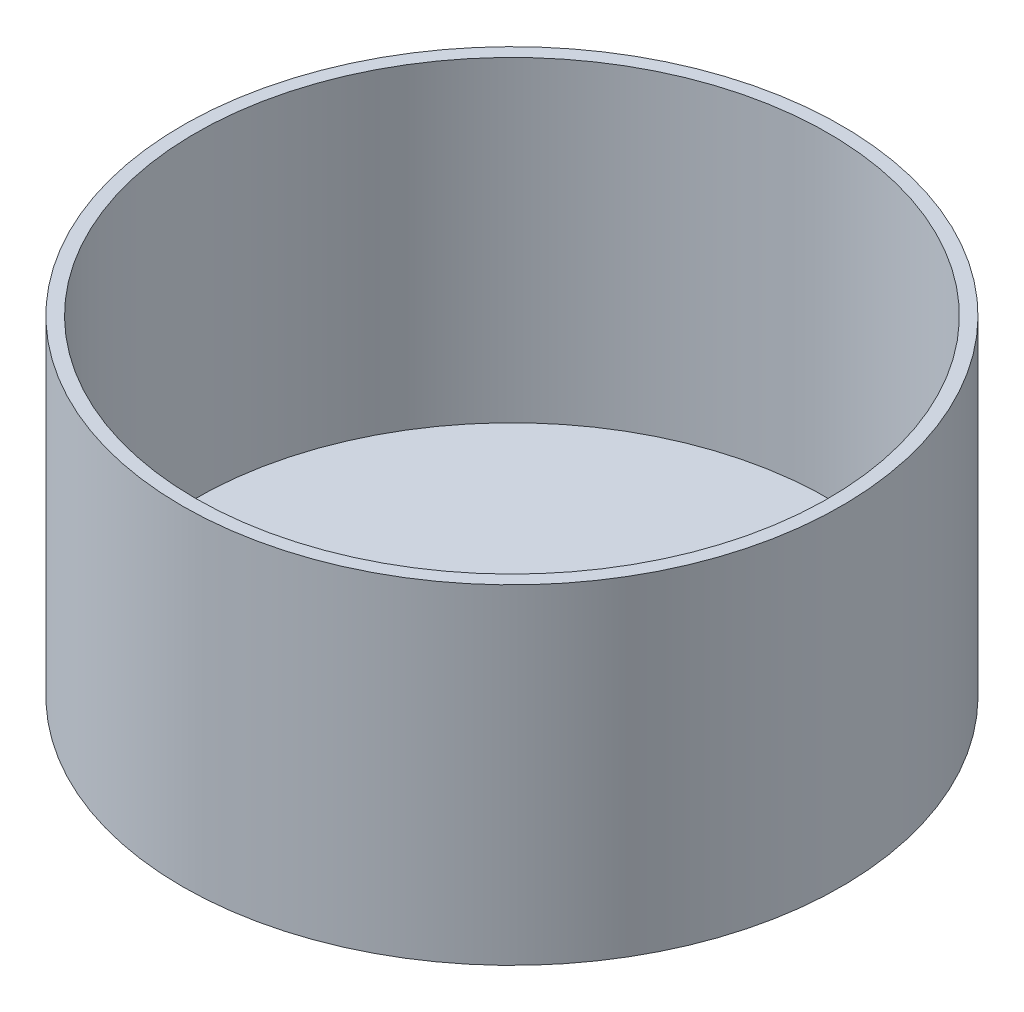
from build123d import *

# Parameters (mm, degrees)
SKETCH1_R           = 63.5
BOSS_EXTRUDE1_DEPTH = 63.5
SHELL1_T            = -2.54


with BuildPart() as part:
    # Sketch1 → Boss-Extrude1 (new body)
    with BuildSketch(Plane(origin=(0, 0, 0), x_dir=(1, 0, 0), z_dir=(0, 1, 0))):
        with Locations(Location((0, 0, 0), (0, 0, 270))):
            Circle(SKETCH1_R)
    extrude(amount=BOSS_EXTRUDE1_DEPTH)

    # Shell1
    shell1_openings = [part.faces().sort_by_distance(p)[0] for p in [
        (0, 63.5, 0),
    ]]
    offset(amount=SHELL1_T, openings=shell1_openings, kind=Kind.INTERSECTION)


solid = part.part
